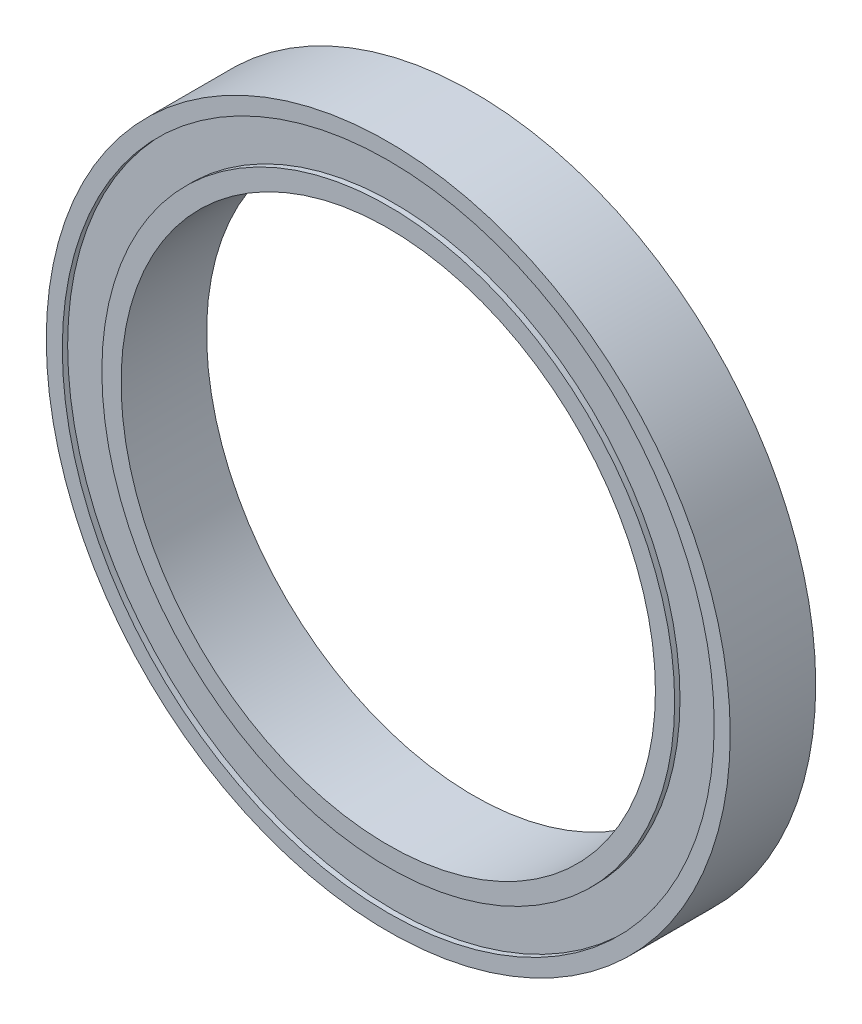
from build123d import *


with BuildPart() as part:
    # Esquisse1 → R_volution1 (revolve)
    with BuildSketch(Plane(origin=(0, 0, 0), x_dir=(0, 0, -1), z_dir=(1, 0, 0)), mode=Mode.PRIVATE) as r_volution1_sk:
        Polygon((0, 30.5), (0.5, 30.5), (0.5, 26.8), (0, 26.8), (0, 25), (8, 25), (8, 26.8), (7.5, 26.8), (7.5, 30.5), (8, 30.5), (8, 32), (0, 32), align=None)
    revolve(r_volution1_sk.sketch.rotate(Axis((0, 0, 4.635721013), (0, 0, -1)), 90), axis=Axis((0, 0, 4.635721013), (0, 0, -1)))


solid = part.part
